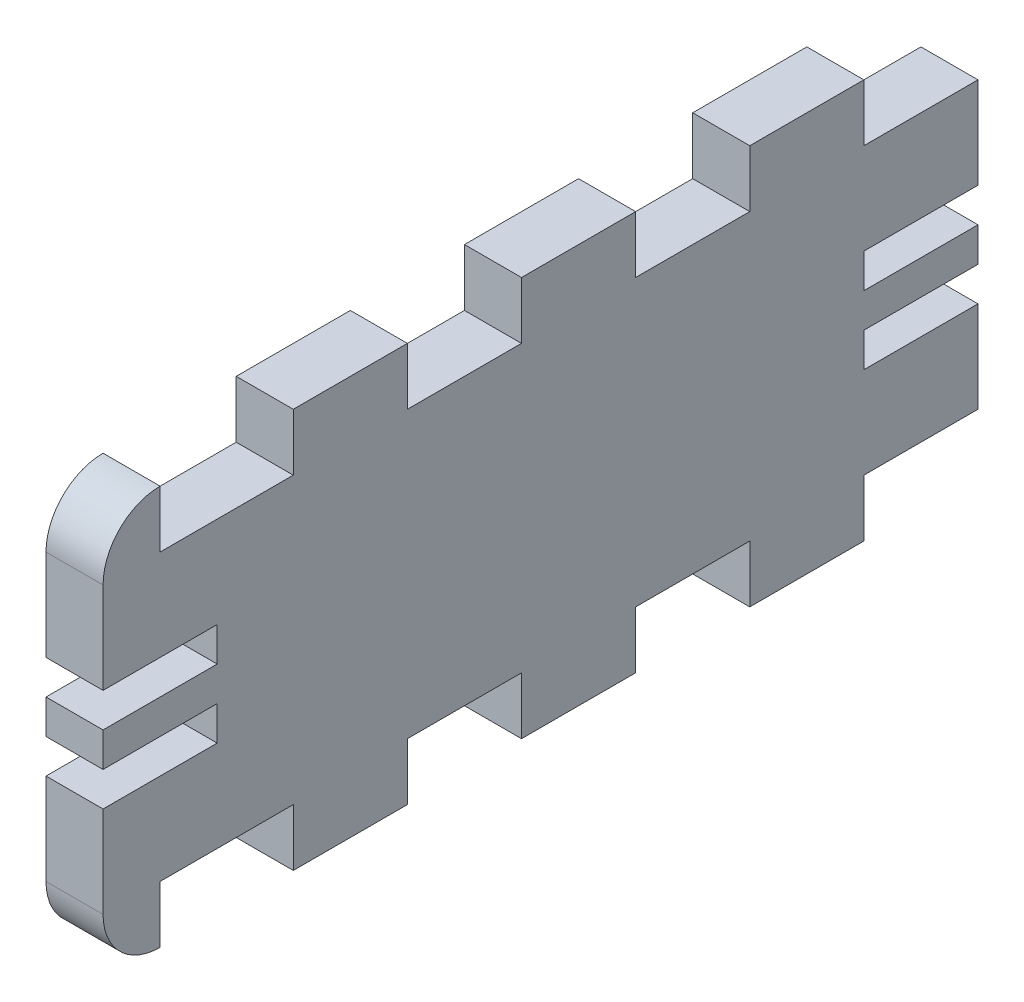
from build123d import *

# Parameters (mm, degrees)
SKETCH1_W           = 46
SKETCH1_H           = 21
BOSS_EXTRUDE1_DEPTH = 3
FILLET1_R           = 3
SKETCH2_W           = 6
SKETCH2_H           = 1.8
CUT_EXTRUDE1_DEPTH  = 10
SKETCH3_W           = 7
SKETCH3_H           = 3
SKETCH3_W_2         = 6
CUT_EXTRUDE2_DEPTH  = 10


with BuildPart() as part:
    # Sketch1 → Boss-Extrude1 (new body)
    with BuildSketch(Plane(origin=(0, 0, 0), x_dir=(0, 0, -1), z_dir=(1, 0, 0))):
        Rectangle(SKETCH1_W, SKETCH1_H)
    extrude(amount=BOSS_EXTRUDE1_DEPTH)

    # Fillet1
    fillet1_edges = [part.edges().sort_by_distance(p)[0] for p in [
        (1.5, -10.5, 23),
        (1.5, 10.5, 23),
    ]]
    fillet(fillet1_edges, radius=FILLET1_R)

    # Sketch2 → Cut-Extrude1 (cut)
    with BuildSketch(Plane.ZY):
        with Locations((20, 1.8)):
            Rectangle(SKETCH2_W, SKETCH2_H)
        with Locations((-20, -1.8)):
            Rectangle(SKETCH2_W, SKETCH2_H)
        with Locations((20, -1.8)):
            Rectangle(SKETCH2_W, SKETCH2_H)
        with Locations((-20, 1.8)):
            Rectangle(SKETCH2_W, SKETCH2_H)
    extrude(amount=-CUT_EXTRUDE1_DEPTH, mode=Mode.SUBTRACT)

    # Sketch3 → Cut-Extrude2 (cut)
    with BuildSketch(Plane(origin=(3, 0, 0), x_dir=(0, 0, -1), z_dir=(1, 0, 0))):
        with Locations((-16.5, 9)):
            Rectangle(SKETCH3_W, SKETCH3_H)
        with Locations((-4, 9)):
            Rectangle(SKETCH3_W_2, SKETCH3_H)
        with Locations((8, 9)):
            Rectangle(SKETCH3_W_2, SKETCH3_H)
        with Locations((20, 9)):
            Rectangle(SKETCH3_W_2, SKETCH3_H)
        with Locations((20, -9)):
            Rectangle(SKETCH3_W_2, SKETCH3_H)
        with Locations((8, -9)):
            Rectangle(SKETCH3_W_2, SKETCH3_H)
        with Locations((-4, -9)):
            Rectangle(SKETCH3_W_2, SKETCH3_H)
        with Locations((-16.5, -9)):
            Rectangle(SKETCH3_W, SKETCH3_H)
    extrude(amount=-CUT_EXTRUDE2_DEPTH, mode=Mode.SUBTRACT)


solid = part.part
